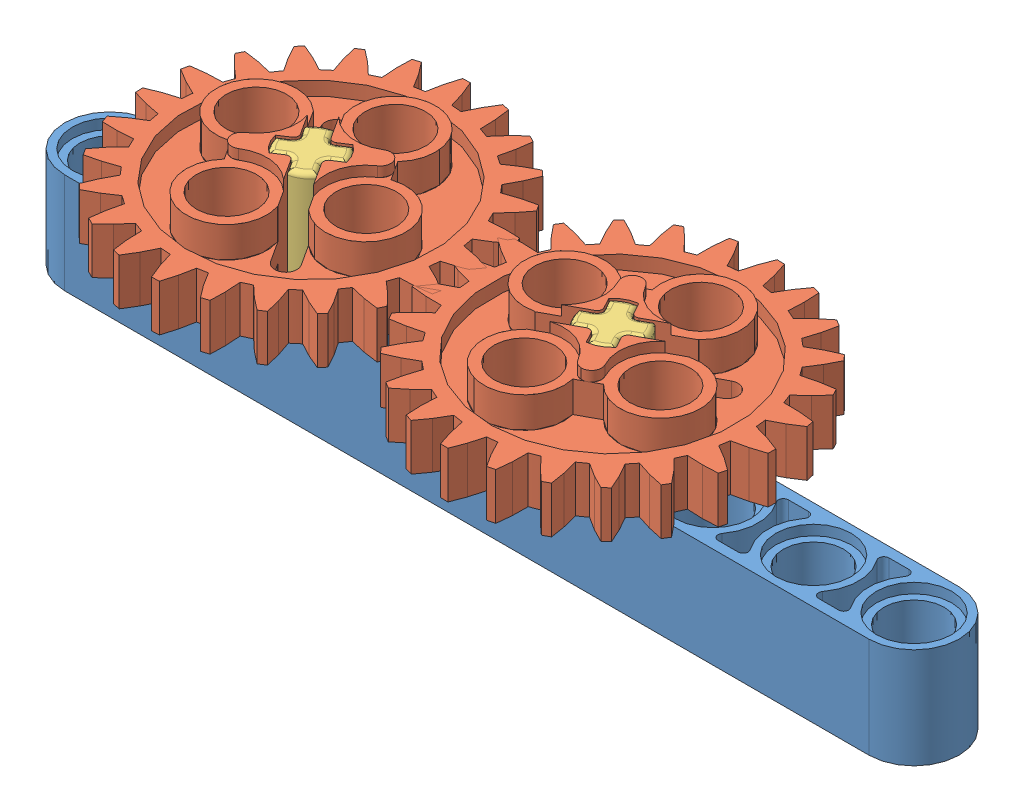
SolidWorks assembly Assem3.sldasm, configuration Default (file format 12000). Lengths in mm.
Overall size (71.2 16 36.09).
5 component instances, 3 part files, 11 mates.
Components (placement in the parent):
- 40490 Beam 9 Red-1: 40490 Beam 9 Red.SLDPRT [Default] at (5.1438 37.7982 65.5259) size (71.2 8 7.2)
- 3648 Gear 24-1: 3648 Gear 24.SLDPRT [Default] at (45.1438 49.7982 65.5259) x (0.879305 0 -0.476259) z (0.476259 0 0.879305) size (26.1 8 26.1)
- 3749 Axle Pin without Friction Ridges Lengthwise-1: 3749 Axle Pin without Friction Ridges Lengthwise.SLDPRT [Default] at (45.1438 45.7982 65.5259) x (0.476259 0 0.879305) z (-0.879305 0 0.476259) size (6 16 6)
- 3648 Gear 24-2: 3648 Gear 24.SLDPRT [Default] at (21.1438 49.7982 65.5259) x (-0.542688 0 -0.839934) z (0.839934 0 -0.542688) size (26.1 8 26.1)
- 3749 Axle Pin without Friction Ridges Lengthwise-2: 3749 Axle Pin without Friction Ridges Lengthwise.SLDPRT [Default] at (21.1438 45.7982 65.5259) x (0.839934 0 -0.542688) z (0.542688 0 0.839934) size (6 16 6)
Mates (geometry in assembly coordinates):
- Concentric1: concentric anti-aligned: cylinder of 40490 Beam 9 Red-1 through (21.1438 45.7982 65.5259) axis (0 -1 0) radius 2.4; cylinder of 3749 Axle Pin without Friction Ridges Lengthwise-2 through (21.1438 37.7982 65.5259) axis (0 1 0) radius 2.4
- Coincident1: coincident anti-aligned: plane of 40490 Beam 9 Red-1 through (21.1438 44.9982 65.5259) normal (0 1 0); plane of 3749 Axle Pin without Friction Ridges Lengthwise-2 through (21.1438 44.9982 65.5259) normal (0 -1 0)
- Concentric2: concentric anti-aligned: cylinder of 40490 Beam 9 Red-1 through (45.1438 45.7982 65.5259) axis (0 -1 0) radius 2.4; cylinder of 3749 Axle Pin without Friction Ridges Lengthwise-1 through (45.1438 37.7982 65.5259) axis (0 1 0) radius 2.4
- Coincident2: coincident anti-aligned: plane of 40490 Beam 9 Red-1 through (45.1438 44.9982 65.5259) normal (0 1 0); plane of 3749 Axle Pin without Friction Ridges Lengthwise-1 through (45.1438 44.9982 65.5259) normal (0 -1 0)
- Concentric3: concentric anti-aligned: cylinder of 3648 Gear 24-2 through (21.1438 45.7982 65.5259) axis (0 1 0) radius 2.4; cylinder of 3749 Axle Pin without Friction Ridges Lengthwise-2 through (21.1438 53.7982 65.5259) axis (0 -1 0) radius 2.4
- Coincident3: coincident anti-aligned: plane of 3648 Gear 24-2 through (20.5463 45.7982 66.9596) normal (-0.542688 0 -0.839934); plane of 3749 Axle Pin without Friction Ridges Lengthwise-2 through (22.6965 53.7982 65.5704) normal (0.542688 0 0.839934)
- Coincident4: coincident anti-aligned: plane of 40490 Beam 9 Red-1 through (5.1438 45.7982 65.5259) normal (0 1 0); plane of 3648 Gear 24-2 through (17.8198 45.7982 67.7177) normal (0 -1 0)
- Concentric4: concentric anti-aligned: cylinder of 3648 Gear 24-1 through (45.1438 45.7982 65.5259) axis (0 1 0) radius 2.4; cylinder of 3749 Axle Pin without Friction Ridges Lengthwise-1 through (45.1438 53.7982 65.5259) axis (0 -1 0) radius 2.4
- Coincident5: coincident anti-aligned: plane of 3648 Gear 24-1 through (43.7604 45.7982 64.8195) normal (0.879305 0 -0.476259); plane of 3749 Axle Pin without Friction Ridges Lengthwise-1 through (44.9796 53.7982 67.0705) normal (-0.879305 0 0.476259)
- Coincident6: coincident anti-aligned: plane of 40490 Beam 9 Red-1 through (5.1438 45.7982 65.5259) normal (0 1 0); plane of 3648 Gear 24-1 through (43.215 45.7982 62.0426) normal (0 -1 0)
- GearMate1: gear = 19.5 mm: circle of 3648 Gear 24-2; circle of 3648 Gear 24-1
